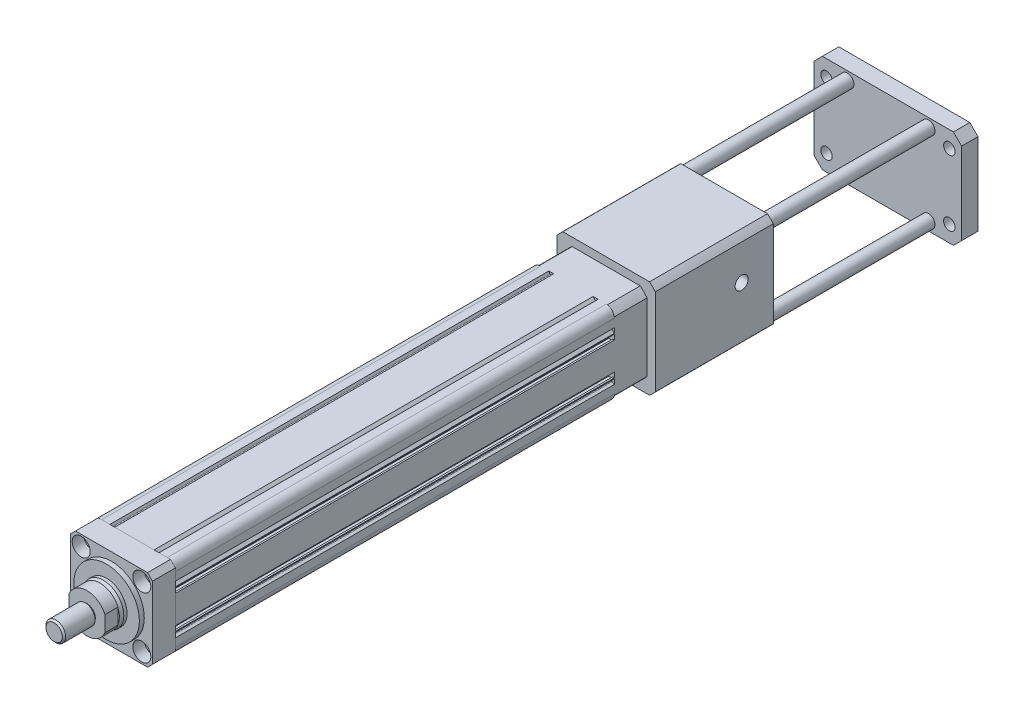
from build123d import *

# Parameters (mm, degrees)
SKETCH_1_R                  = 20
SKETCH_1_R_2                = 2.75
EXTRUDE_1_DEPTH             = 268
FILLET_1_R                  = 5
EXTRUDE_2_DEPTH             = 14
SKETCH_3_R                  = 20
EXTRUDE_3_DEPTH             = 3
SKETCH_5_R                  = 12.5
EXTRUDE_4_DEPTH             = 4
CHAMFER_1_SIZE              = 2
CHAMFER_1_SIZE2             = 0.7
EXTRUDE_5_DEPTH             = 8
SKETCH_7_R                  = 5.15
EXTRUDE_6_DEPTH             = 1
SKETCH_8_R                  = 6
EXTRUDE_7_DEPTH             = 19
CHAMFER_2_SIZE              = 1
SKETCH_23_W                 = 50
SKETCH_23_H                 = 50
EXTRUDE_8_DEPTH             = 20
SKETCH_24_R                 = 42.5
SKETCH_24_R_2               = 32.5
CUT_EXTRUDE_1_DEPTH         = 20
SKETCH_28_W                 = 60
SKETCH_28_H                 = 60
EXTRUDE_9_DEPTH             = 72
SKETCH_4_R                  = 3.5
CUT_EXTRUDE_5_DEPTH         = 30
SKETCH_4_6_R                = 5.5
CUT_EXTRUDE_6_DEPTH         = 7
CUT_EXTRUDE_START           = -72
SKETCH_30_R                 = 3.5
CUT_EXTRUDE_7_DEPTH         = 72
SKETCH_30_4_R               = 5.5
CUT_EXTRUDE_8_DEPTH         = 50
HOLE_WIZARD_M5_1_AT_2_COUNT = 2
HOLE_WIZARD_M5_1_AT_2_PITCH = 49.497474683
HOLE_WIZARD_M5_1_AT_3_COUNT = 2
HOLE_WIZARD_M5_1_AT_3_PITCH = 70
HOLE_WIZARD_M5_1_AT_4_COUNT = 2
HOLE_WIZARD_M5_1_AT_4_PITCH = 49.497474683
SKETCH_33_R                 = 19
CUT_EXTRUDE_9_DEPTH         = 65
SKETCH_33_3_R               = 25
CUT_EXTRUDE_10_DEPTH        = 6.5
SKETCH_34_R                 = 50
SKETCH_34_R_2               = 40
CUT_EXTRUDE_2_DEPTH         = 72
SKETCH_35_R                 = 4
CUT_EXTRUDE_11_DEPTH        = 22
SKETCH_36_R                 = 4
CUT_EXTRUDE_12_DEPTH        = 22
EXTRUDE_START               = 100
SKETCH_38_W                 = 90
SKETCH_38_H                 = 60
SKETCH_38_R                 = 3.5
EXTRUDE_10_DEPTH            = 10
SKETCH_39_R                 = 4
EXTRUDE_11_DEPTH            = 110
EXTRUDE_12_DEPTH            = 1
CHAMFER_3_SIZE              = 5


with BuildPart() as part:
    # Sketch 1 → Extrude 1 (new body)
    with BuildSketch(Plane.XY):
        with BuildLine():
            Line((-25, 25), (-15, 25))
            Line((-15, 25), (-14.227730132, 23.662389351))
            ThreePointArc((-14.227730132, 23.662389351), (-13.859980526, 23.416666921), (-13.441164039, 23.558835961))
            Line((-13.441164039, 23.558835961), (-12, 25))
            Line((-12, 25), (12, 25))
            Line((12, 25), (13.441164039, 23.558835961))
            ThreePointArc((13.441164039, 23.558835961), (13.859980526, 23.416666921), (14.227730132, 23.662389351))
            Line((14.227730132, 23.662389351), (15, 25))
            Line((15, 25), (25, 25))
            Line((25, 25), (25, 15))
            Line((25, 15), (23.662389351, 14.227730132))
            ThreePointArc((23.662389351, 14.227730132), (23.416666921, 13.859980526), (23.558835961, 13.441164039))
            Line((23.558835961, 13.441164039), (25, 12))
            Line((25, 12), (25, 11.5))
            Line((25, 11.5), (24, 11.5))
            Line((24, 11.5), (24, 12.4))
            Line((24, 12.4), (21.5, 12.4))
            Line((21.5, 12.4), (21.5, 7.6))
            Line((21.5, 7.6), (24, 7.6))
            Line((24, 7.6), (24, 8.5))
            Line((24, 8.5), (25, 8.5))
            Line((25, 8.5), (25, -8.5))
            Line((25, -8.5), (24, -8.5))
            Line((24, -8.5), (24, -7.6))
            Line((24, -7.6), (21.5, -7.6))
            Line((21.5, -7.6), (21.5, -12.4))
            Line((21.5, -12.4), (24, -12.4))
            Line((24, -12.4), (24, -11.5))
            Line((24, -11.5), (25, -11.5))
            Line((25, -11.5), (25, -12))
            Line((25, -12), (23.558835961, -13.441164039))
            ThreePointArc((23.558835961, -13.441164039), (23.416666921, -13.859980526), (23.662389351, -14.227730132))
            Line((23.662389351, -14.227730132), (25, -15))
            Line((25, -15), (25, -25))
            Line((25, -25), (15, -25))
            Line((15, -25), (14.227730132, -23.662389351))
            ThreePointArc((14.227730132, -23.662389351), (13.859980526, -23.416666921), (13.441164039, -23.558835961))
            Line((13.441164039, -23.558835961), (12, -25))
            Line((12, -25), (11.5, -25))
            Line((11.5, -25), (11.5, -24))
            Line((11.5, -24), (12.4, -24))
            Line((12.4, -24), (12.4, -21.5))
            Line((12.4, -21.5), (7.6, -21.5))
            Line((7.6, -21.5), (7.6, -24))
            Line((7.6, -24), (8.5, -24))
            Line((8.5, -24), (8.5, -25))
            Line((8.5, -25), (-8.5, -25))
            Line((-8.5, -25), (-8.5, -24))
            Line((-8.5, -24), (-7.6, -24))
            Line((-7.6, -24), (-7.6, -21.5))
            Line((-7.6, -21.5), (-12.4, -21.5))
            Line((-12.4, -21.5), (-12.4, -24))
            Line((-12.4, -24), (-11.5, -24))
            Line((-11.5, -24), (-11.5, -25))
            Line((-11.5, -25), (-12, -25))
            Line((-12, -25), (-13.441164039, -23.558835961))
            ThreePointArc((-13.441164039, -23.558835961), (-13.859980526, -23.416666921), (-14.227730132, -23.662389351))
            Line((-14.227730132, -23.662389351), (-15, -25))
            Line((-15, -25), (-25, -25))
            Line((-25, -25), (-25, -15))
            Line((-25, -15), (-23.662389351, -14.227730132))
            ThreePointArc((-23.662389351, -14.227730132), (-23.416666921, -13.859980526), (-23.558835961, -13.441164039))
            Line((-23.558835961, -13.441164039), (-25, -12))
            Line((-25, -12), (-25, -11.5))
            Line((-25, -11.5), (-24, -11.5))
            Line((-24, -11.5), (-24, -12.4))
            Line((-24, -12.4), (-21.5, -12.4))
            Line((-21.5, -12.4), (-21.5, -7.6))
            Line((-21.5, -7.6), (-24, -7.6))
            Line((-24, -7.6), (-24, -8.5))
            Line((-24, -8.5), (-25, -8.5))
            Line((-25, -8.5), (-25, 8.5))
            Line((-25, 8.5), (-24, 8.5))
            Line((-24, 8.5), (-24, 7.6))
            Line((-24, 7.6), (-21.5, 7.6))
            Line((-21.5, 7.6), (-21.5, 12.4))
            Line((-21.5, 12.4), (-24, 12.4))
            Line((-24, 12.4), (-24, 11.5))
            Line((-24, 11.5), (-25, 11.5))
            Line((-25, 11.5), (-25, 12))
            Line((-25, 12), (-23.558835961, 13.441164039))
            ThreePointArc((-23.558835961, 13.441164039), (-23.416666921, 13.859980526), (-23.662389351, 14.227730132))
            Line((-23.662389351, 14.227730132), (-25, 15))
            Line((-25, 15), (-25, 25))
        make_face()
        Circle(SKETCH_1_R, mode=Mode.SUBTRACT)
        with Locations((-18.5, 18.5)):
            Circle(SKETCH_1_R_2, mode=Mode.SUBTRACT)
        with Locations((18.5, 18.5)):
            Circle(SKETCH_1_R_2, mode=Mode.SUBTRACT)
        with Locations((18.5, -18.5)):
            Circle(SKETCH_1_R_2, mode=Mode.SUBTRACT)
        with Locations((-18.5, -18.5)):
            Circle(SKETCH_1_R_2, mode=Mode.SUBTRACT)
        with BuildLine():
            Line((-13.868836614, 23), (-5, 23))
            ThreePointArc((-5, 23), (-4.502985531, 22.554558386), (-4.891534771, 22.01190647))
            ThreePointArc((-4.891534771, 22.01190647), (-10.498377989, 19.955831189), (-15.368836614, 16.5))
            Line((-15.368836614, 16.5), (-15.368836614, 21.5))
            Line((-15.368836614, 21.5), (-13.868836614, 23))
        make_face(mode=Mode.SUBTRACT)
        with BuildLine():
            Line((15.368836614, 16.5), (15.368836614, 21.5))
            Line((15.368836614, 21.5), (13.868836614, 23))
            Line((13.868836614, 23), (5, 23))
            ThreePointArc((5, 23), (4.502985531, 22.554558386), (4.891534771, 22.01190647))
            ThreePointArc((4.891534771, 22.01190647), (10.498377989, 19.955831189), (15.368836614, 16.5))
        make_face(mode=Mode.SUBTRACT)
    extrude(amount=EXTRUDE_1_DEPTH)

    # Fillet 1
    fillet_1_edges = [part.edges().sort_by_distance(p)[0] for p in [
        (-25, 25, 134),
        (25, 25, 134),
        (25, -25, 134),
        (-25, -25, 134),
    ]]
    fillet(fillet_1_edges, radius=FILLET_1_R)

    # Sketch 23 → Extrude 8 (add)
    with BuildSketch(Plane(origin=(0, 0, 0), x_dir=(-1, 0, 0), z_dir=(0, 0, -1))):
        Rectangle(SKETCH_23_W, SKETCH_23_H)
    extrude(amount=EXTRUDE_8_DEPTH)

    # Sketch 24 → Cut-Extrude 1 (cut)
    with BuildSketch(Plane(origin=(0, 0, -20), x_dir=(-1, 0, 0), z_dir=(0, 0, -1))):
        Circle(SKETCH_24_R)
        Circle(SKETCH_24_R_2, mode=Mode.SUBTRACT)
    extrude(amount=-CUT_EXTRUDE_1_DEPTH, mode=Mode.SUBTRACT)

    # Sketch 27 → Hole Wizard M6 _1 (revolve, cut)
    with BuildSketch(Plane(origin=(0, -25, -12), x_dir=(0, 0, -1), z_dir=(1, 0, 0))):
        Polygon((0, 0), (0, 8.502151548), (2.5, 7), (2.5, 0), align=None)
    revolve(axis=Axis((0, -31.35, -12), (0, 1, 0)), mode=Mode.SUBTRACT)


with BuildPart() as body_2:
    # Sketch 2 → Extrude 2 (new body)
    with BuildSketch(Plane.XY.offset(268)):
        Polygon((-25, 22), (-22, 25), (22, 25), (25, 22), (25, -22), (22, -25), (-22, -25), (-25, -22), align=None)
    extrude(amount=EXTRUDE_2_DEPTH)


with BuildPart() as body_3:
    # Sketch 3 → Extrude 3 (new body)
    with BuildSketch(Plane.XY.offset(282)):
        Circle(SKETCH_3_R)
    extrude(amount=EXTRUDE_3_DEPTH)


with BuildPart() as body_4:
    # Sketch 5 → Extrude 4 (new body)
    with BuildSketch(Plane.XY.offset(285)):
        Circle(SKETCH_5_R)
    extrude(amount=EXTRUDE_4_DEPTH)

    # Chamfer 1
    chamfer_1_edges = [body_4.edges().sort_by_distance(p)[0] for p in [
        (-12.5, 0, 289),
    ]]
    chamfer_1_side = [body_4.faces().sort_by_distance(p)[0] for p in [
        (-12.5, 0, 287),
    ]]
    chamfer(chamfer_1_edges, length=CHAMFER_1_SIZE, length2=CHAMFER_1_SIZE2, reference=chamfer_1_side[0])


with BuildPart() as body_5:
    # Sketch 6 → Extrude 5 (new body)
    with BuildSketch(Plane.XY.offset(289)):
        with BuildLine():
            Line((-11, 4.795831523), (-11, -4.795831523))
            ThreePointArc((-11, -4.795831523), (0, -12), (11, -4.795831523))
            Line((11, -4.795831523), (11, 4.795831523))
            ThreePointArc((11, 4.795831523), (0, 12), (-11, 4.795831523))
        make_face()
    extrude(amount=EXTRUDE_5_DEPTH)


with BuildPart() as body_6:
    # Sketch 7 → Extrude 6 (new body)
    with BuildSketch(Plane.XY.offset(297)):
        Circle(SKETCH_7_R)
    extrude(amount=EXTRUDE_6_DEPTH)


with BuildPart() as body_7:
    # Sketch 8 → Extrude 7 (new body)
    with BuildSketch(Plane.XY.offset(298)):
        Circle(SKETCH_8_R)
    extrude(amount=EXTRUDE_7_DEPTH)

    # Chamfer 2
    chamfer_2_edges = [body_7.edges().sort_by_distance(p)[0] for p in [
        (-6, 0, 317),
    ]]
    chamfer(chamfer_2_edges, length=CHAMFER_2_SIZE)


with BuildPart() as body_8:
    # Sketch 28 → Extrude 9 (new body)
    with BuildSketch(Plane(origin=(0, 0, -20), x_dir=(-1, 0, 0), z_dir=(0, 0, -1))):
        Rectangle(SKETCH_28_W, SKETCH_28_H)
    extrude(amount=EXTRUDE_9_DEPTH)

    # Sketch 30 → Cut-Extrude 7 (cut)
    with BuildSketch(Plane(origin=(0, 0, -92), x_dir=(-1, 0, 0), z_dir=(0, 0, -1)).offset(CUT_EXTRUDE_START)):
        with Locations((-16.099900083, 18.5)):
            Circle(SKETCH_30_R)
        with Locations((19.700049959, 17.299950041)):
            Circle(SKETCH_30_R)
        with Locations((18.5, -18.5)):
            Circle(SKETCH_30_R)
        with Locations((-17.299950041, -17.299950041)):
            Circle(SKETCH_30_R)
    extrude(amount=CUT_EXTRUDE_7_DEPTH, mode=Mode.SUBTRACT)

    # Sketch 30_4 → Cut-Extrude 8 (cut)
    with BuildSketch(Plane(origin=(0, 0, -92), x_dir=(-1, 0, 0), z_dir=(0, 0, -1))):
        with Locations((18.5, -18.5)):
            Circle(SKETCH_30_4_R)
        with Locations((-17.299950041, -17.299950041)):
            Circle(SKETCH_30_4_R)
        with Locations((-16.099900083, 18.5)):
            Circle(SKETCH_30_4_R)
        with Locations((19.700049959, 17.299950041)):
            Circle(SKETCH_30_4_R)
    extrude(amount=-CUT_EXTRUDE_8_DEPTH, mode=Mode.SUBTRACT)

    # Sketch 32 → Hole Wizard M5 _1 (revolve, cut)
    with BuildSketch(Plane(origin=(-24.748737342, -24.748737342, -92), x_dir=(0, 1, 0), z_dir=(1, 0, 0))):
        Polygon((0, 0), (0, 15.2618073), (2.1, 14), (2.1, 0), align=None)
    hole_wizard_m5_1 = revolve(axis=Axis((-24.748737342, -24.748737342, -98.35), (0, 0, 1)), mode=Mode.SUBTRACT)

    # Hole Wizard M5 _1 at 2: Hole Wizard M5 _1 ×2
    with Locations(*[(i * HOLE_WIZARD_M5_1_AT_2_PITCH, 0, 0) for i in range(1, HOLE_WIZARD_M5_1_AT_2_COUNT)]):
        add(hole_wizard_m5_1, mode=Mode.SUBTRACT)

    # Hole Wizard M5 _1 at 3: Hole Wizard M5 _1 ×2
    with Locations(*[Vector(0.7071067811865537, 0.7071067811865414, 0) * (i * HOLE_WIZARD_M5_1_AT_3_PITCH) for i in range(1, HOLE_WIZARD_M5_1_AT_3_COUNT)]):
        add(hole_wizard_m5_1, mode=Mode.SUBTRACT)

    # Hole Wizard M5 _1 at 4: Hole Wizard M5 _1 ×2
    with Locations(*[(0, i * HOLE_WIZARD_M5_1_AT_4_PITCH, 0) for i in range(1, HOLE_WIZARD_M5_1_AT_4_COUNT)]):
        add(hole_wizard_m5_1, mode=Mode.SUBTRACT)

    # Sketch 33 → Cut-Extrude 9 (cut)
    with BuildSketch(Plane(origin=(0, 0, -92), x_dir=(-1, 0, 0), z_dir=(0, 0, -1))):
        Circle(SKETCH_33_R)
    extrude(amount=-CUT_EXTRUDE_9_DEPTH, mode=Mode.SUBTRACT)

    # Sketch 33_3 → Cut-Extrude 10 (cut)
    with BuildSketch(Plane(origin=(0, 0, -92), x_dir=(-1, 0, 0), z_dir=(0, 0, -1))):
        Circle(SKETCH_33_3_R)
    extrude(amount=-CUT_EXTRUDE_10_DEPTH, mode=Mode.SUBTRACT)

    # Sketch 34 → Cut-Extrude 2 (cut)
    with BuildSketch(Plane(origin=(0, 0, -92), x_dir=(-1, 0, 0), z_dir=(0, 0, -1))):
        Circle(SKETCH_34_R)
        Circle(SKETCH_34_R_2, mode=Mode.SUBTRACT)
    extrude(amount=-CUT_EXTRUDE_2_DEPTH, mode=Mode.SUBTRACT)

    # Sketch 35 → Cut-Extrude 11 (cut)
    with BuildSketch(Plane(origin=(30, 0, 0), x_dir=(0, 0, -1), z_dir=(1, 0, 0))):
        with Locations((72.713697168, 4.902306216)):
            Circle(SKETCH_35_R)
    extrude(amount=-CUT_EXTRUDE_11_DEPTH, mode=Mode.SUBTRACT)

    # Sketch 36 → Cut-Extrude 12 (cut)
    with BuildSketch(Plane.ZY.offset(30)):
        with Locations((-37.731412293, -10.555978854)):
            Circle(SKETCH_36_R)
    extrude(amount=-CUT_EXTRUDE_12_DEPTH, mode=Mode.SUBTRACT)



with BuildPart() as cut_extrude_5_tool:
    # Sketch 4 → Cut-Extrude 5 (new body)
    with BuildSketch(Plane.XY.offset(282)):
        with Locations((-35, 17.5)):
            Circle(SKETCH_4_R)
        with Locations((-18.5, 18.5)):
            Circle(SKETCH_4_R)
        with Locations(Location((-18.5, -18.5, 0), (0, 0, 180))):
            Circle(SKETCH_4_R)
        with Locations((-35, -17.5)):
            Circle(SKETCH_4_R)
        with Locations((35, -17.5)):
            Circle(SKETCH_4_R)
        with Locations((18.5, -18.5)):
            Circle(SKETCH_4_R)
        with Locations(Location((18.5, 18.5, 0), (0, 0, 180))):
            Circle(SKETCH_4_R)
        with Locations((35, 17.5)):
            Circle(SKETCH_4_R)
    extrude(amount=-CUT_EXTRUDE_5_DEPTH)


with BuildPart() as part_1:
    add(part.part)

    # Cut-Extrude 5: cut by cut_extrude_5_tool
    add(cut_extrude_5_tool.part, mode=Mode.SUBTRACT)


with BuildPart() as body_2_1:
    add(body_2.part)

    # Cut-Extrude 5: cut by cut_extrude_5_tool
    add(cut_extrude_5_tool.part, mode=Mode.SUBTRACT)

    # Sketch 4_6 → Cut-Extrude 6 (cut)
    with BuildSketch(Plane.XY.offset(282)):
        with Locations((-18.5, 18.5)):
            Circle(SKETCH_4_6_R)
        with Locations(Location((-18.5, -18.5, 0), (0, 0, 180))):
            Circle(SKETCH_4_6_R)
        with Locations((18.5, -18.5)):
            Circle(SKETCH_4_6_R)
        with Locations(Location((18.5, 18.5, 0), (0, 0, 180))):
            Circle(SKETCH_4_6_R)
    extrude(amount=-CUT_EXTRUDE_6_DEPTH, mode=Mode.SUBTRACT)


with BuildPart() as body_9:
    # Sketch 38 → Extrude 10 (new body)
    with BuildSketch(Plane(origin=(0, 0, -92), x_dir=(-1, 0, 0), z_dir=(0, 0, -1)).offset(EXTRUDE_START)):
        Rectangle(SKETCH_38_W, SKETCH_38_H)
        with Locations((-37.5, 20)):
            Circle(SKETCH_38_R, mode=Mode.SUBTRACT)
        with Locations((-37.5, -20)):
            Circle(SKETCH_38_R, mode=Mode.SUBTRACT)
        with Locations(Location((37.5, -20, 0), (0, 0, 180))):
            Circle(SKETCH_38_R, mode=Mode.SUBTRACT)
        with Locations(Location((37.5, 20, 0), (0, 0, 180))):
            Circle(SKETCH_38_R, mode=Mode.SUBTRACT)
    extrude(amount=EXTRUDE_10_DEPTH)


with BuildPart() as body_8_1:
    add(body_8.part)

    add(body_9.part)  # Extrude 11 merges body 9
    # Sketch 39 → Extrude 11 (add)
    with BuildSketch(Plane(origin=(0, 0, -202), x_dir=(-1, 0, 0), z_dir=(0, 0, -1))):
        with Locations((-24.748737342, 24.748737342)):
            Circle(SKETCH_39_R)
        with Locations((24.748737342, 24.748737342)):
            Circle(SKETCH_39_R)
        with Locations((-24.748737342, -24.748737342)):
            Circle(SKETCH_39_R)
        with Locations((24.748737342, -24.748737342)):
            Circle(SKETCH_39_R)
    extrude(amount=-EXTRUDE_11_DEPTH)

    # Sketch 40 → Extrude 12 (add)
    with BuildSketch(Plane(origin=(0, 0, -92), x_dir=(-1, 0, 0), z_dir=(0, 0, -1))):
        with BuildLine():
            ThreePointArc((-11.862525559, 22.006373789), (-19.710535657, 22.648892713), (-20.157746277, 14.787334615))
            ThreePointArc((-20.157746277, 14.787334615), (-24.984992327, 0.866116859), (-21.133347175, -13.355958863))
            ThreePointArc((-21.133347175, -13.355958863), (-21.189037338, -21.189037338), (-13.355958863, -21.133347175))
            ThreePointArc((-13.355958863, -21.133347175), (0.140128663, -24.999607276), (13.592026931, -20.982297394))
            ThreePointArc((13.592026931, -20.982297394), (22.389087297, -22.389087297), (20.982297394, -13.592026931))
            ThreePointArc((20.982297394, -13.592026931), (24.987170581, -0.800816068), (21.809568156, 12.220586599))
            ThreePointArc((21.809568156, 12.220586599), (23.832727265, 20.929134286), (14.935785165, 20.048000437))
            ThreePointArc((14.935785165, 20.048000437), (1.822097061, 24.93351083), (-11.862525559, 22.006373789))
        make_face()
    extrude(amount=-EXTRUDE_12_DEPTH)

    # Chamfer 3
    chamfer_3_edges = [body_8_1.edges().sort_by_distance(p)[0] for p in [
        (-45, -30, -197),
        (-45, 30, -197),
        (45, 30, -197),
        (45, -30, -197),
    ]]
    chamfer(chamfer_3_edges, length=CHAMFER_3_SIZE)


solid = Compound([body_3.part, body_4.part, body_5.part, body_6.part, body_7.part, part_1.part, body_2_1.part, body_8_1.part])
